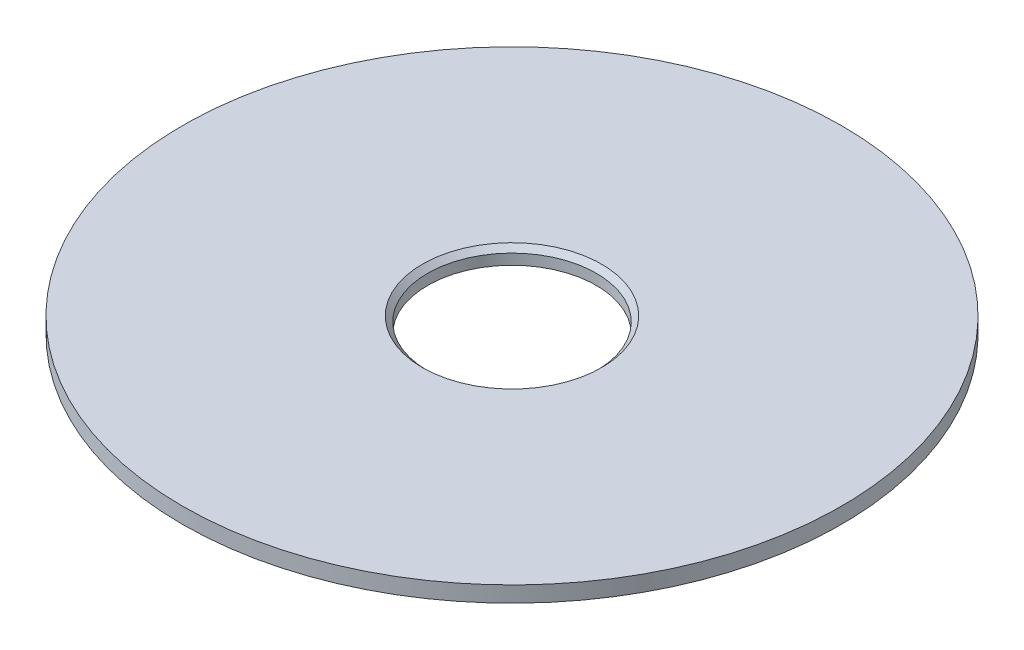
ISO-10303-21;
HEADER;
FILE_DESCRIPTION(('STEP AP214'),'2;1');
FILE_NAME('part.step','',(''),(''),'','','');
FILE_SCHEMA(('AUTOMOTIVE_DESIGN { 1 0 10303 214 1 1 1 1 }'));
ENDSEC;
DATA;
#1=APPLICATION_CONTEXT('core data for automotive mechanical design processes');
#2=APPLICATION_PROTOCOL_DEFINITION('international standard','automotive_design',2000,#1);
#3=PRODUCT_CONTEXT('',#1,'mechanical');
#4=PRODUCT('Part','Part','',(#3));
#5=PRODUCT_RELATED_PRODUCT_CATEGORY('part','',(#4));
#6=PRODUCT_DEFINITION_FORMATION('','',#4);
#7=PRODUCT_DEFINITION_CONTEXT('part definition',#1,'design');
#8=PRODUCT_DEFINITION('design','',#6,#7);
#9=PRODUCT_DEFINITION_SHAPE('','',#8);
#10=(LENGTH_UNIT() NAMED_UNIT(*) SI_UNIT(.MILLI.,.METRE.));
#11=(NAMED_UNIT(*) PLANE_ANGLE_UNIT() SI_UNIT($,.RADIAN.));
#12=(NAMED_UNIT(*) SI_UNIT($,.STERADIAN.) SOLID_ANGLE_UNIT());
#13=UNCERTAINTY_MEASURE_WITH_UNIT(LENGTH_MEASURE(1.E-05),#10,'distance_accuracy_value','');
#14=(GEOMETRIC_REPRESENTATION_CONTEXT(3) GLOBAL_UNCERTAINTY_ASSIGNED_CONTEXT((#13)) GLOBAL_UNIT_ASSIGNED_CONTEXT((#10,
#11,#12)) REPRESENTATION_CONTEXT('',''));
#15=CARTESIAN_POINT('',(0.,0.,0.));
#16=DIRECTION('',(0.,0.,1.));
#17=DIRECTION('',(1.,0.,0.));
#18=AXIS2_PLACEMENT_3D('',#15,#16,#17);
#19=CARTESIAN_POINT('',(0.,-1.5,0.));
#20=DIRECTION('',(0.,1.,0.));
#21=DIRECTION('',(0.,0.,1.));
#22=AXIS2_PLACEMENT_3D('',#19,#20,#21);
#23=CYLINDRICAL_SURFACE('',#22,31.25);
#24=CARTESIAN_POINT('',(0.,-1.5,0.));
#25=DIRECTION('',(0.,1.,0.));
#26=DIRECTION('',(0.,0.,1.));
#27=AXIS2_PLACEMENT_3D('',#24,#25,#26);
#28=CIRCLE('',#27,31.25);
#29=CARTESIAN_POINT('',(0.,-1.5,31.25));
#30=VERTEX_POINT('',#29);
#31=EDGE_CURVE('E42',#30,#30,#28,.T.);
#32=ORIENTED_EDGE('',*,*,#31,.T.);
#33=EDGE_LOOP('',(#32));
#34=FACE_BOUND('',#33,.T.);
#35=CARTESIAN_POINT('',(0.,0.,0.));
#36=DIRECTION('',(0.,1.,0.));
#37=DIRECTION('',(0.,0.,1.));
#38=AXIS2_PLACEMENT_3D('',#35,#36,#37);
#39=CIRCLE('',#38,31.25);
#40=CARTESIAN_POINT('',(0.,0.,31.25));
#41=VERTEX_POINT('',#40);
#42=EDGE_CURVE('E46',#41,#41,#39,.T.);
#43=ORIENTED_EDGE('',*,*,#42,.F.);
#44=EDGE_LOOP('',(#43));
#45=FACE_BOUND('',#44,.T.);
#46=ADVANCED_FACE('F31',(#34,#45),#23,.T.);
#47=CARTESIAN_POINT('',(0.,-1.5,0.));
#48=DIRECTION('',(0.,1.,0.));
#49=DIRECTION('',(0.,0.,1.));
#50=AXIS2_PLACEMENT_3D('',#47,#48,#49);
#51=PLANE('',#50);
#52=CARTESIAN_POINT('',(0.,-1.5,0.));
#53=DIRECTION('',(0.,1.,0.));
#54=DIRECTION('',(0.,0.,1.));
#55=AXIS2_PLACEMENT_3D('',#52,#53,#54);
#56=CIRCLE('',#55,8.);
#57=CARTESIAN_POINT('',(0.,-1.5,8.));
#58=VERTEX_POINT('',#57);
#59=EDGE_CURVE('E50',#58,#58,#56,.T.);
#60=ORIENTED_EDGE('',*,*,#59,.T.);
#61=EDGE_LOOP('',(#60));
#62=FACE_BOUND('',#61,.T.);
#63=ORIENTED_EDGE('',*,*,#31,.F.);
#64=EDGE_LOOP('',(#63));
#65=FACE_BOUND('',#64,.T.);
#66=ADVANCED_FACE('F55',(#62,#65),#51,.F.);
#67=CARTESIAN_POINT('',(0.,0.,0.));
#68=DIRECTION('',(0.,1.,0.));
#69=DIRECTION('',(0.,0.,1.));
#70=AXIS2_PLACEMENT_3D('',#67,#68,#69);
#71=PLANE('',#70);
#72=CARTESIAN_POINT('',(0.,0.,0.));
#73=DIRECTION('',(0.,1.,0.));
#74=DIRECTION('',(0.,0.,1.));
#75=AXIS2_PLACEMENT_3D('',#72,#73,#74);
#76=CIRCLE('',#75,8.49999999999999);
#77=CARTESIAN_POINT('',(0.,0.,8.49999999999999));
#78=VERTEX_POINT('',#77);
#79=EDGE_CURVE('E10',#78,#78,#76,.F.);
#80=ORIENTED_EDGE('',*,*,#79,.T.);
#81=EDGE_LOOP('',(#80));
#82=FACE_BOUND('',#81,.T.);
#83=ORIENTED_EDGE('',*,*,#42,.T.);
#84=EDGE_LOOP('',(#83));
#85=FACE_BOUND('',#84,.T.);
#86=ADVANCED_FACE('F60',(#82,#85),#71,.T.);
#87=CARTESIAN_POINT('',(0.,-1.5,0.));
#88=DIRECTION('',(0.,1.,0.));
#89=DIRECTION('',(0.,0.,1.));
#90=AXIS2_PLACEMENT_3D('',#87,#88,#89);
#91=CYLINDRICAL_SURFACE('',#90,8.);
#92=CARTESIAN_POINT('',(0.,-0.499999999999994,0.));
#93=DIRECTION('',(0.,1.,0.));
#94=DIRECTION('',(0.,0.,1.));
#95=AXIS2_PLACEMENT_3D('',#92,#93,#94);
#96=CIRCLE('',#95,8.);
#97=CARTESIAN_POINT('',(0.,-0.499999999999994,8.));
#98=VERTEX_POINT('',#97);
#99=EDGE_CURVE('E38',#98,#98,#96,.T.);
#100=ORIENTED_EDGE('',*,*,#99,.T.);
#101=EDGE_LOOP('',(#100));
#102=FACE_BOUND('',#101,.T.);
#103=ORIENTED_EDGE('',*,*,#59,.F.);
#104=EDGE_LOOP('',(#103));
#105=FACE_BOUND('',#104,.T.);
#106=ADVANCED_FACE('F58',(#102,#105),#91,.F.);
#107=CARTESIAN_POINT('',(0.,-0.499999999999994,0.));
#108=DIRECTION('',(0.,1.,0.));
#109=DIRECTION('',(0.,0.,1.));
#110=AXIS2_PLACEMENT_3D('',#107,#108,#109);
#111=CONICAL_SURFACE('',#110,8.,0.785398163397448);
#112=ORIENTED_EDGE('',*,*,#79,.F.);
#113=EDGE_LOOP('',(#112));
#114=FACE_BOUND('',#113,.T.);
#115=ORIENTED_EDGE('',*,*,#99,.F.);
#116=EDGE_LOOP('',(#115));
#117=FACE_BOUND('',#116,.T.);
#118=ADVANCED_FACE('F33',(#114,#117),#111,.F.);
#119=CLOSED_SHELL('',(#46,#66,#86,#106,#118));
#120=MANIFOLD_SOLID_BREP('B2',#119);
#121=ADVANCED_BREP_SHAPE_REPRESENTATION('',(#18,#120),#14);
#122=SHAPE_DEFINITION_REPRESENTATION(#9,#121);
ENDSEC;
END-ISO-10303-21;
